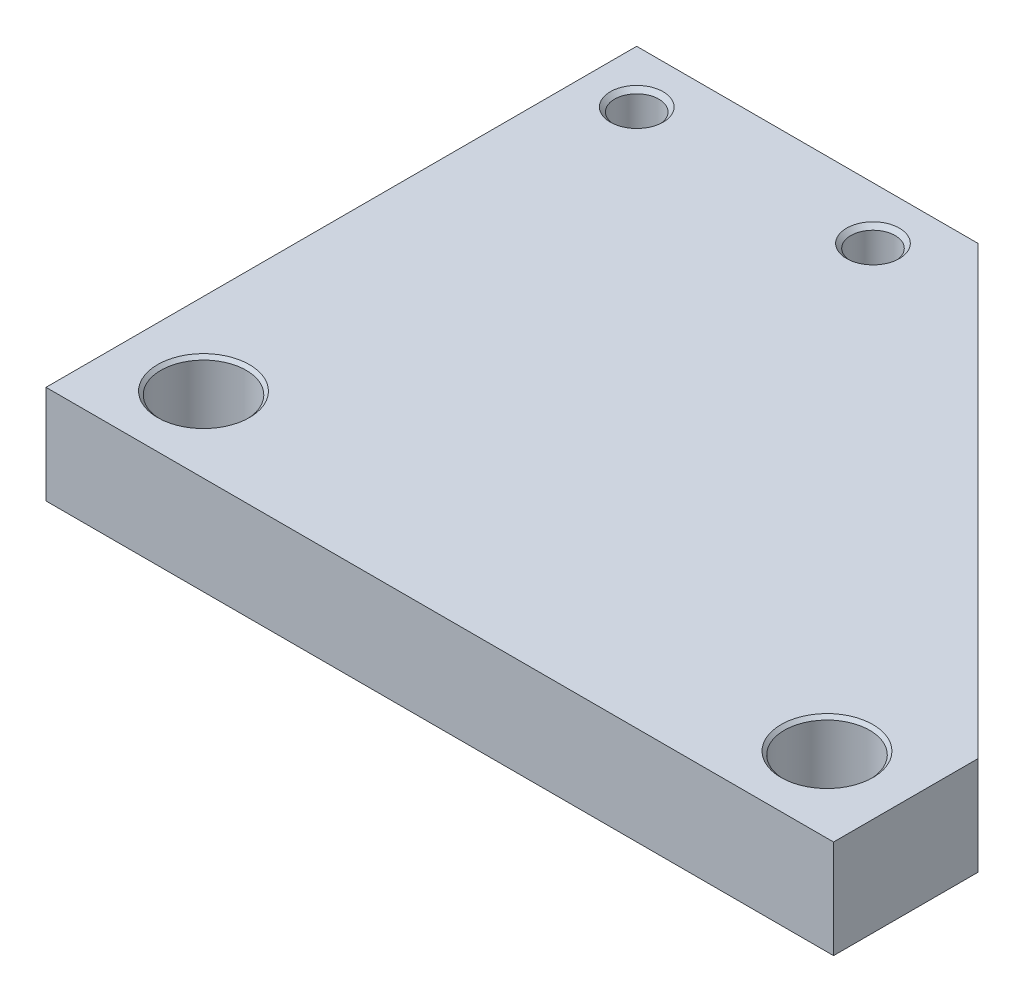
from build123d import *

# Parameters (mm, degrees)
EXTRUDE_1_DEPTH                  = 15
HOLE_WIZARD_1_AT_2_COUNT         = 2
HOLE_WIZARD_1_AT_2_PITCH         = 36
HOLE_WIZARD_13_0_13_1_AT_2_COUNT = 2
HOLE_WIZARD_13_0_13_1_AT_2_PITCH = 95


with BuildPart() as part:
    # Sketch 1 → Extrude 1 (new body)
    with BuildSketch(Plane(origin=(0, 0, 0), x_dir=(1, 0, 0), z_dir=(0, 1, 0))):
        Polygon((-67.99, 0), (-119.99, 0), (-120, -0.01), (-120, -90), (0, -90), (0, -67.99), align=None)
    extrude(amount=EXTRUDE_1_DEPTH)

    # Sketch 4 → Hole Wizard 1 (revolve, cut)
    with BuildSketch(Plane(origin=(-111.99, 15, 8), x_dir=(0, 0, 1), z_dir=(1, 0, 0))):
        Polygon((0, 0), (0, 15), (4.025, 15), (3.375, 14.35), (3.375, 0.65), (4.025, 0), align=None)
    hole_wizard_1 = revolve(axis=Axis((-111.99, 21.35, 8), (0, -1, 0)), mode=Mode.SUBTRACT)

    # Hole Wizard 1 at 2: Hole Wizard 1 ×2
    with Locations(*[(i * HOLE_WIZARD_1_AT_2_PITCH, 0, 0) for i in range(1, HOLE_WIZARD_1_AT_2_COUNT)]):
        add(hole_wizard_1, mode=Mode.SUBTRACT)

    # Sketch 6 → Hole Wizard 13.0 _13_1 (revolve, cut)
    with BuildSketch(Plane(origin=(-107.5, 15, 78.5), x_dir=(0, 0, 1), z_dir=(1, 0, 0))):
        Polygon((0, 0), (0, 15), (7, 15), (6.5, 14.5), (6.5, 0.5), (7, 0), align=None)
    hole_wizard_13_0_13_1 = revolve(axis=Axis((-107.5, 21.35, 78.5), (0, -1, 0)), mode=Mode.SUBTRACT)

    # Hole Wizard 13.0 _13_1 at 2: Hole Wizard 13.0 _13_1 ×2
    with Locations(*[(i * HOLE_WIZARD_13_0_13_1_AT_2_PITCH, 0, 0) for i in range(1, HOLE_WIZARD_13_0_13_1_AT_2_COUNT)]):
        add(hole_wizard_13_0_13_1, mode=Mode.SUBTRACT)


solid = part.part
